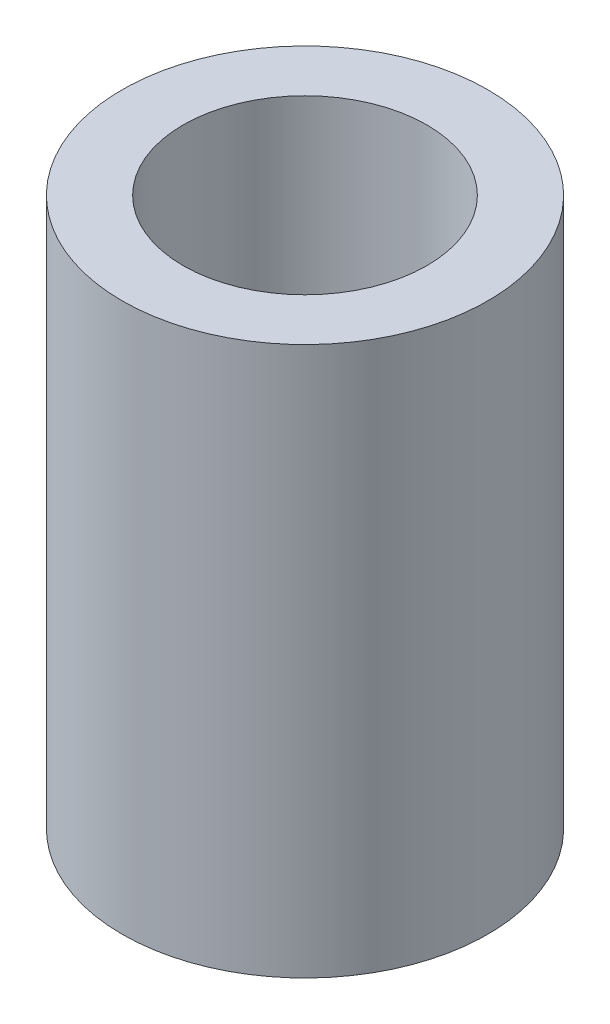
from build123d import *

# Parameters (mm, degrees)
SKETCH1_R           = 1.5
SKETCH1_R_2         = 1
BOSS_EXTRUDE1_DEPTH = 4.5


with BuildPart() as part:
    # Sketch1 → Boss-Extrude1 (new body)
    with BuildSketch(Plane(origin=(0, 0, 0), x_dir=(1, 0, 0), z_dir=(0, 1, 0))):
        with Locations(Location((0, 0, 0), (0, 0, 270))):
            Circle(SKETCH1_R)
        with Locations(Location((0, 0, 0), (0, 0, 270))):
            Circle(SKETCH1_R_2, mode=Mode.SUBTRACT)
    extrude(amount=BOSS_EXTRUDE1_DEPTH)


solid = part.part
